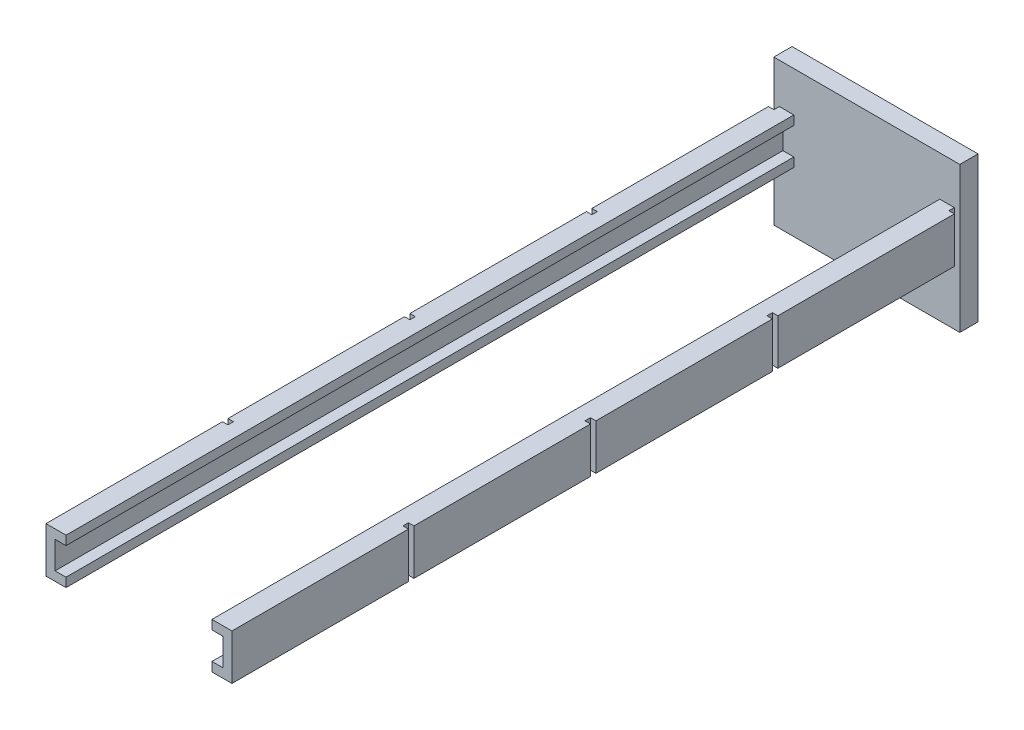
from build123d import *

# Parameters (mm, degrees)
BOSS_EXTRU_1_DEPTH         = 400
BOSS_EXTRU_1_2_DEPTH       = 400
ESQUISSE2_W                = 102.2
ESQUISSE2_H                = 80
BOSS_EXTRU_2_DEPTH         = 10
ESQUISSE3_W                = 2.991250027
ESQUISSE3_H                = 25
ENL_V_MAT_EXTRU_1_DEPTH    = 3
R_P_TITION_LIN_AIRE1_COUNT = 4
R_P_TITION_LIN_AIRE1_PITCH = 100
SYM_TRIE1_COPY_1_SKETCH_W  = 2.991250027
SYM_TRIE1_COPY_1_SKETCH_H  = 25
SYM_TRIE1_COPY_1_DEPTH     = 3
SYM_TRIE1_COPY_2_SKETCH_W  = 2.991250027
SYM_TRIE1_COPY_2_SKETCH_H  = 25
SYM_TRIE1_COPY_2_DEPTH     = 3
SYM_TRIE1_COPY_3_SKETCH_W  = 2.991250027
SYM_TRIE1_COPY_3_SKETCH_H  = 25
SYM_TRIE1_COPY_3_DEPTH     = 3


with BuildPart() as part:
    # Esquisse1 → Boss.-Extru.1 (new body)
    with BuildSketch(Plane.XY):
        Polygon((-40.1, -7.5), (-40.1, -12.5), (-51.1, -12.5), (-51.1, 12.5), (-40.1, 12.5), (-40.1, 7.5), (-46.1, 7.5), (-46.1, -7.5), align=None)
    extrude(amount=BOSS_EXTRU_1_DEPTH)



with BuildPart() as body_2:
    # Esquisse1 → Boss.-Extru.1 2 (new body)
    with BuildSketch(Plane.XY):
        Polygon((51.1, 12.5), (51.1, -12.5), (40.1, -12.5), (40.1, -7.5), (46.1, -7.5), (46.1, 7.5), (40.1, 7.5), (40.1, 12.5), align=None)
    extrude(amount=BOSS_EXTRU_1_2_DEPTH)


with BuildPart() as part_1:
    add(part.part)

    add(body_2.part)  # Boss.-Extru.2 merges body 2
    # Esquisse2 → Boss.-Extru.2 (add)
    with BuildSketch(Plane(origin=(0, 0, 0), x_dir=(-1, 0, 0), z_dir=(0, 0, -1))):
        with Locations((0, -5.441452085)):
            Rectangle(ESQUISSE2_W, ESQUISSE2_H)
    extrude(amount=BOSS_EXTRU_2_DEPTH)

    # Esquisse3 → Enl_v. mat.-Extru.1 (cut)
    with BuildSketch(Plane(origin=(51.1, 0, 0), x_dir=(0, 0, -1), z_dir=(1, 0, 0))):
        with Locations((-1.495625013, 0)):
            Rectangle(ESQUISSE3_W, ESQUISSE3_H)
    enl_v_mat_extru_1 = extrude(amount=-ENL_V_MAT_EXTRU_1_DEPTH, mode=Mode.SUBTRACT)

    # R_p_tition lin_aire1: Enl_v. mat.-Extru.1 ×4
    with Locations(*[(0, 0, i * R_P_TITION_LIN_AIRE1_PITCH) for i in range(1, R_P_TITION_LIN_AIRE1_COUNT)]):
        add(enl_v_mat_extru_1, mode=Mode.SUBTRACT)

    # Sym_trie1: Enl_v. mat.-Extru.1 across plane
    add(enl_v_mat_extru_1.mirror(Plane(origin=(0, 0, 0), x_dir=(0, 0, 1), z_dir=(1, 0, 0))), mode=Mode.SUBTRACT)

    # Sym_trie1 copy 1 sketch → Sym_trie1 copy 1 (cut)
    with BuildSketch(Plane(origin=(-51.1, 0, 100), x_dir=(0, 0, -1), z_dir=(-1, 0, 0))):
        with Locations((-1.495625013, 0)):
            Rectangle(SYM_TRIE1_COPY_1_SKETCH_W, SYM_TRIE1_COPY_1_SKETCH_H)
    extrude(amount=-SYM_TRIE1_COPY_1_DEPTH, mode=Mode.SUBTRACT)

    # Sym_trie1 copy 2 sketch → Sym_trie1 copy 2 (cut)
    with BuildSketch(Plane(origin=(-51.1, 0, 200), x_dir=(0, 0, -1), z_dir=(-1, 0, 0))):
        with Locations((-1.495625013, 0)):
            Rectangle(SYM_TRIE1_COPY_2_SKETCH_W, SYM_TRIE1_COPY_2_SKETCH_H)
    extrude(amount=-SYM_TRIE1_COPY_2_DEPTH, mode=Mode.SUBTRACT)

    # Sym_trie1 copy 3 sketch → Sym_trie1 copy 3 (cut)
    with BuildSketch(Plane(origin=(-51.1, 0, 300), x_dir=(0, 0, -1), z_dir=(-1, 0, 0))):
        with Locations((-1.495625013, 0)):
            Rectangle(SYM_TRIE1_COPY_3_SKETCH_W, SYM_TRIE1_COPY_3_SKETCH_H)
    extrude(amount=-SYM_TRIE1_COPY_3_DEPTH, mode=Mode.SUBTRACT)


solid = part_1.part
